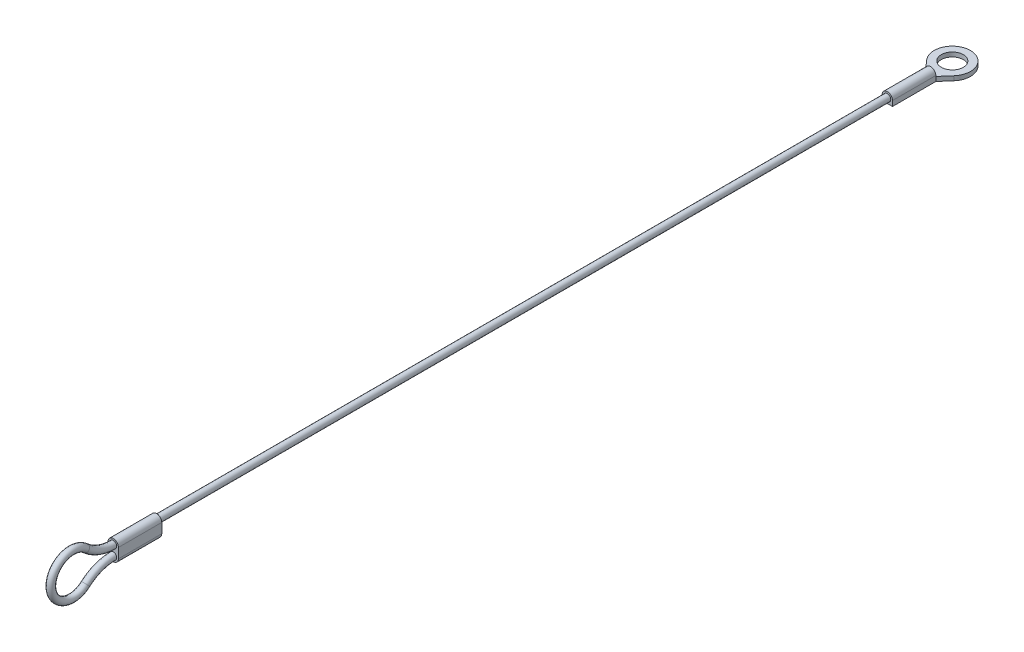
ISO-10303-21;
HEADER;
FILE_DESCRIPTION(('STEP AP214'),'2;1');
FILE_NAME('part.step','',(''),(''),'','','');
FILE_SCHEMA(('AUTOMOTIVE_DESIGN { 1 0 10303 214 1 1 1 1 }'));
ENDSEC;
DATA;
#1=APPLICATION_CONTEXT('core data for automotive mechanical design processes');
#2=APPLICATION_PROTOCOL_DEFINITION('international standard','automotive_design',2000,#1);
#3=PRODUCT_CONTEXT('',#1,'mechanical');
#4=PRODUCT('Part','Part','',(#3));
#5=PRODUCT_RELATED_PRODUCT_CATEGORY('part','',(#4));
#6=PRODUCT_DEFINITION_FORMATION('','',#4);
#7=PRODUCT_DEFINITION_CONTEXT('part definition',#1,'design');
#8=PRODUCT_DEFINITION('design','',#6,#7);
#9=PRODUCT_DEFINITION_SHAPE('','',#8);
#10=(LENGTH_UNIT() NAMED_UNIT(*) SI_UNIT(.MILLI.,.METRE.));
#11=(NAMED_UNIT(*) PLANE_ANGLE_UNIT() SI_UNIT($,.RADIAN.));
#12=(NAMED_UNIT(*) SI_UNIT($,.STERADIAN.) SOLID_ANGLE_UNIT());
#13=UNCERTAINTY_MEASURE_WITH_UNIT(LENGTH_MEASURE(1.E-05),#10,'distance_accuracy_value','');
#14=(GEOMETRIC_REPRESENTATION_CONTEXT(3) GLOBAL_UNCERTAINTY_ASSIGNED_CONTEXT((#13)) GLOBAL_UNIT_ASSIGNED_CONTEXT((#10,
#11,#12)) REPRESENTATION_CONTEXT('',''));
#15=CARTESIAN_POINT('',(0.,0.,0.));
#16=DIRECTION('',(0.,0.,1.));
#17=DIRECTION('',(1.,0.,0.));
#18=AXIS2_PLACEMENT_3D('',#15,#16,#17);
#19=CARTESIAN_POINT('',(0.,0.,-10.));
#20=DIRECTION('',(0.,0.,-1.));
#21=DIRECTION('',(-1.,0.,0.));
#22=AXIS2_PLACEMENT_3D('',#19,#20,#21);
#23=PLANE('',#22);
#24=DIRECTION('',(0.,-1.,0.));
#25=VECTOR('',#24,1.);
#26=CARTESIAN_POINT('',(1.195,0.,-10.));
#27=LINE('',#26,#25);
#28=CARTESIAN_POINT('',(1.195,0.,-10.));
#29=VERTEX_POINT('',#28);
#30=CARTESIAN_POINT('',(1.195,-0.185,-10.));
#31=VERTEX_POINT('',#30);
#32=EDGE_CURVE('E169',#29,#31,#27,.T.);
#33=ORIENTED_EDGE('',*,*,#32,.T.);
#34=DIRECTION('',(-1.,0.,0.));
#35=VECTOR('',#34,1.);
#36=CARTESIAN_POINT('',(-1.195,-0.185,-10.));
#37=LINE('',#36,#35);
#38=CARTESIAN_POINT('',(-1.195,-0.185,-10.));
#39=VERTEX_POINT('',#38);
#40=EDGE_CURVE('E138',#31,#39,#37,.T.);
#41=ORIENTED_EDGE('',*,*,#40,.T.);
#42=DIRECTION('',(0.,1.,0.));
#43=VECTOR('',#42,1.);
#44=CARTESIAN_POINT('',(-1.195,-1.195,-10.));
#45=LINE('',#44,#43);
#46=CARTESIAN_POINT('',(-1.195,0.,-10.));
#47=VERTEX_POINT('',#46);
#48=EDGE_CURVE('E173',#39,#47,#45,.T.);
#49=ORIENTED_EDGE('',*,*,#48,.T.);
#50=CARTESIAN_POINT('',(0.,0.,-10.));
#51=DIRECTION('',(0.,0.,-1.));
#52=DIRECTION('',(-1.,0.,0.));
#53=AXIS2_PLACEMENT_3D('',#50,#51,#52);
#54=CIRCLE('',#53,1.195);
#55=EDGE_CURVE('E166',#47,#29,#54,.T.);
#56=ORIENTED_EDGE('',*,*,#55,.T.);
#57=EDGE_LOOP('',(#33,#41,#49,#56));
#58=FACE_BOUND('',#57,.T.);
#59=ADVANCED_FACE('F33',(#58),#23,.T.);
#60=CARTESIAN_POINT('',(0.,0.,178.6));
#61=DIRECTION('',(0.,0.,-1.));
#62=DIRECTION('',(-1.,0.,0.));
#63=AXIS2_PLACEMENT_3D('',#60,#61,#62);
#64=CYLINDRICAL_SURFACE('',#63,0.795);
#65=CARTESIAN_POINT('',(0.,0.,168.6));
#66=DIRECTION('',(0.,0.,-1.));
#67=DIRECTION('',(0.,1.,0.));
#68=AXIS2_PLACEMENT_3D('',#65,#66,#67);
#69=CIRCLE('',#68,0.795);
#70=CARTESIAN_POINT('',(-0.795,0.,168.6));
#71=VERTEX_POINT('',#70);
#72=EDGE_CURVE('E37',#71,#71,#69,.T.);
#73=CARTESIAN_POINT('',(0.,0.,0.));
#74=DIRECTION('',(0.,0.,1.));
#75=DIRECTION('',(1.,0.,0.));
#76=AXIS2_PLACEMENT_3D('',#73,#74,#75);
#77=CIRCLE('',#76,0.795);
#78=CARTESIAN_POINT('',(-0.795,0.,0.));
#79=VERTEX_POINT('',#78);
#80=EDGE_CURVE('E195',#79,#79,#77,.T.);
#81=CARTESIAN_POINT('',(-0.795,0.,168.6));
#82=CARTESIAN_POINT('',(-0.795,0.,166.84375));
#83=CARTESIAN_POINT('',(-0.795,0.,165.0875));
#84=CARTESIAN_POINT('',(-0.795,0.,161.575));
#85=CARTESIAN_POINT('',(-0.795,0.,159.81875));
#86=CARTESIAN_POINT('',(-0.795,0.,156.30625));
#87=CARTESIAN_POINT('',(-0.795,0.,154.55));
#88=CARTESIAN_POINT('',(-0.795,0.,151.0375));
#89=CARTESIAN_POINT('',(-0.795,0.,149.28125));
#90=CARTESIAN_POINT('',(-0.795,0.,145.76875));
#91=CARTESIAN_POINT('',(-0.795,0.,144.0125));
#92=CARTESIAN_POINT('',(-0.795,0.,140.5));
#93=CARTESIAN_POINT('',(-0.795,0.,138.74375));
#94=CARTESIAN_POINT('',(-0.795,0.,135.23125));
#95=CARTESIAN_POINT('',(-0.795,0.,133.475));
#96=CARTESIAN_POINT('',(-0.795,0.,129.9625));
#97=CARTESIAN_POINT('',(-0.795,0.,128.20625));
#98=CARTESIAN_POINT('',(-0.795,0.,124.69375));
#99=CARTESIAN_POINT('',(-0.795,0.,122.9375));
#100=CARTESIAN_POINT('',(-0.795,0.,119.425));
#101=CARTESIAN_POINT('',(-0.795,0.,117.66875));
#102=CARTESIAN_POINT('',(-0.795,0.,114.15625));
#103=CARTESIAN_POINT('',(-0.795,0.,112.4));
#104=CARTESIAN_POINT('',(-0.795,0.,108.8875));
#105=CARTESIAN_POINT('',(-0.795,0.,107.13125));
#106=CARTESIAN_POINT('',(-0.795,0.,103.61875));
#107=CARTESIAN_POINT('',(-0.795,0.,101.8625));
#108=CARTESIAN_POINT('',(-0.795,0.,98.35));
#109=CARTESIAN_POINT('',(-0.795,0.,96.59375));
#110=CARTESIAN_POINT('',(-0.795,0.,93.08125));
#111=CARTESIAN_POINT('',(-0.795,0.,91.325));
#112=CARTESIAN_POINT('',(-0.795,0.,87.8125));
#113=CARTESIAN_POINT('',(-0.795,0.,86.05625));
#114=CARTESIAN_POINT('',(-0.795,0.,82.54375));
#115=CARTESIAN_POINT('',(-0.795,0.,80.7875));
#116=CARTESIAN_POINT('',(-0.795,0.,77.275));
#117=CARTESIAN_POINT('',(-0.795,0.,75.51875));
#118=CARTESIAN_POINT('',(-0.795,0.,72.00625));
#119=CARTESIAN_POINT('',(-0.795,0.,70.25));
#120=CARTESIAN_POINT('',(-0.795,0.,66.7375));
#121=CARTESIAN_POINT('',(-0.795,0.,64.98125));
#122=CARTESIAN_POINT('',(-0.795,0.,61.46875));
#123=CARTESIAN_POINT('',(-0.795,0.,59.7125));
#124=CARTESIAN_POINT('',(-0.795,0.,56.2));
#125=CARTESIAN_POINT('',(-0.795,0.,54.44375));
#126=CARTESIAN_POINT('',(-0.795,0.,50.93125));
#127=CARTESIAN_POINT('',(-0.795,0.,49.175));
#128=CARTESIAN_POINT('',(-0.795,0.,45.6625));
#129=CARTESIAN_POINT('',(-0.795,0.,43.90625));
#130=CARTESIAN_POINT('',(-0.795,0.,40.39375));
#131=CARTESIAN_POINT('',(-0.795,0.,38.6375));
#132=CARTESIAN_POINT('',(-0.795,0.,35.125));
#133=CARTESIAN_POINT('',(-0.795,0.,33.36875));
#134=CARTESIAN_POINT('',(-0.795,0.,29.85625));
#135=CARTESIAN_POINT('',(-0.795,0.,28.1));
#136=CARTESIAN_POINT('',(-0.795,0.,24.5875));
#137=CARTESIAN_POINT('',(-0.795,0.,22.83125));
#138=CARTESIAN_POINT('',(-0.795,0.,19.31875));
#139=CARTESIAN_POINT('',(-0.795,0.,17.5625));
#140=CARTESIAN_POINT('',(-0.795,0.,14.05));
#141=CARTESIAN_POINT('',(-0.795,0.,12.29375));
#142=CARTESIAN_POINT('',(-0.795,0.,8.78124999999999));
#143=CARTESIAN_POINT('',(-0.795,0.,7.02499999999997));
#144=CARTESIAN_POINT('',(-0.795,0.,3.51249999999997));
#145=CARTESIAN_POINT('',(-0.795,0.,1.75624999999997));
#146=CARTESIAN_POINT('',(-0.795,0.,0.));
#147=B_SPLINE_CURVE_WITH_KNOTS('',3,(#81,#82,#83,#84,#85,#86,#87,#88,#89,#90,#91,#92,#93,#94,
#95,#96,#97,#98,#99,#100,#101,#102,#103,#104,#105,#106,#107,#108,#109,#110,#111,#112,#113,#114,
#115,#116,#117,#118,#119,#120,#121,#122,#123,#124,#125,#126,#127,#128,#129,#130,#131,#132,#133,
#134,#135,#136,#137,#138,#139,#140,#141,#142,#143,#144,#145,#146),.UNSPECIFIED.,.F.,.F.,(4,2,2,
2,2,2,2,2,2,2,2,2,2,2,2,2,2,2,2,2,2,2,2,2,2,2,2,2,2,2,2,2,4),(0.,5.26875000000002,10.5375,
15.80625,21.075,26.34375,31.6125,36.88125,42.15,47.41875,52.6875,57.95625,63.225,68.49375,
73.7625,79.03125,84.3,89.5687500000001,94.8375,100.10625,105.375,110.64375,115.9125,121.18125,
126.45,131.71875,136.9875,142.25625,147.525,152.79375,158.0625,163.33125,168.6),.UNSPECIFIED.);
#148=EDGE_CURVE('BSEAM35',#71,#79,#147,.T.);
#149=ORIENTED_EDGE('',*,*,#72,.T.);
#150=ORIENTED_EDGE('',*,*,#80,.T.);
#151=ORIENTED_EDGE('',*,*,#148,.T.);
#152=ORIENTED_EDGE('',*,*,#148,.F.);
#153=EDGE_LOOP('',(#149,#151,#150,#152));
#154=FACE_BOUND('',#153,.T.);
#155=ADVANCED_FACE('F35',(#154),#64,.T.);
#156=CARTESIAN_POINT('',(0.,2.43728648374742E-13,168.6));
#157=DIRECTION('',(0.,0.,1.));
#158=DIRECTION('',(0.,-1.,0.));
#159=AXIS2_PLACEMENT_3D('',#156,#157,#158);
#160=CYLINDRICAL_SURFACE('',#159,1.195);
#161=CARTESIAN_POINT('',(0.,2.58184677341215E-13,178.6));
#162=DIRECTION('',(0.,0.,-1.));
#163=DIRECTION('',(0.,1.,0.));
#164=AXIS2_PLACEMENT_3D('',#161,#162,#163);
#165=CIRCLE('',#164,1.195);
#166=CARTESIAN_POINT('',(-1.195,2.58331022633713E-13,178.6));
#167=VERTEX_POINT('',#166);
#168=CARTESIAN_POINT('',(1.195,2.58038332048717E-13,178.6));
#169=VERTEX_POINT('',#168);
#170=EDGE_CURVE('E203',#167,#169,#165,.T.);
#171=ORIENTED_EDGE('',*,*,#170,.T.);
#172=DIRECTION('',(0.,0.,1.));
#173=VECTOR('',#172,1.);
#174=CARTESIAN_POINT('',(1.195,2.43582303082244E-13,168.6));
#175=LINE('',#174,#173);
#176=CARTESIAN_POINT('',(1.195,2.43582303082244E-13,168.6));
#177=VERTEX_POINT('',#176);
#178=EDGE_CURVE('E217',#177,#169,#175,.T.);
#179=ORIENTED_EDGE('',*,*,#178,.F.);
#180=CARTESIAN_POINT('',(0.,2.43728648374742E-13,168.6));
#181=DIRECTION('',(0.,0.,-1.));
#182=DIRECTION('',(0.,1.,0.));
#183=AXIS2_PLACEMENT_3D('',#180,#181,#182);
#184=CIRCLE('',#183,1.195);
#185=CARTESIAN_POINT('',(-1.195,2.4387499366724E-13,168.6));
#186=VERTEX_POINT('',#185);
#187=EDGE_CURVE('E196',#186,#177,#184,.T.);
#188=ORIENTED_EDGE('',*,*,#187,.F.);
#189=DIRECTION('',(0.,0.,1.));
#190=VECTOR('',#189,1.);
#191=CARTESIAN_POINT('',(-1.195,2.4387499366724E-13,168.6));
#192=LINE('',#191,#190);
#193=EDGE_CURVE('E202',#186,#167,#192,.T.);
#194=ORIENTED_EDGE('',*,*,#193,.T.);
#195=EDGE_LOOP('',(#171,#179,#188,#194));
#196=FACE_BOUND('',#195,.T.);
#197=ADVANCED_FACE('F258',(#196),#160,.T.);
#198=CARTESIAN_POINT('',(1.195,2.43582303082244E-13,168.6));
#199=DIRECTION('',(-1.,0.,0.));
#200=DIRECTION('',(0.,-1.,0.));
#201=AXIS2_PLACEMENT_3D('',#198,#199,#200);
#202=PLANE('',#201);
#203=DIRECTION('',(0.,-1.,0.));
#204=VECTOR('',#203,1.);
#205=CARTESIAN_POINT('',(1.195,2.58038332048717E-13,178.6));
#206=LINE('',#205,#204);
#207=CARTESIAN_POINT('',(1.195,-2.26625258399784,178.6));
#208=VERTEX_POINT('',#207);
#209=EDGE_CURVE('E206',#169,#208,#206,.T.);
#210=ORIENTED_EDGE('',*,*,#209,.T.);
#211=DIRECTION('',(0.,0.,1.));
#212=VECTOR('',#211,1.);
#213=CARTESIAN_POINT('',(1.195,-2.26625258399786,168.6));
#214=LINE('',#213,#212);
#215=CARTESIAN_POINT('',(1.195,-2.26625258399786,168.6));
#216=VERTEX_POINT('',#215);
#217=EDGE_CURVE('E214',#216,#208,#214,.T.);
#218=ORIENTED_EDGE('',*,*,#217,.F.);
#219=DIRECTION('',(0.,-1.,0.));
#220=VECTOR('',#219,1.);
#221=CARTESIAN_POINT('',(1.195,2.43582303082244E-13,168.6));
#222=LINE('',#221,#220);
#223=EDGE_CURVE('E88',#177,#216,#222,.T.);
#224=ORIENTED_EDGE('',*,*,#223,.F.);
#225=ORIENTED_EDGE('',*,*,#178,.T.);
#226=EDGE_LOOP('',(#210,#218,#224,#225));
#227=FACE_BOUND('',#226,.T.);
#228=ADVANCED_FACE('F287',(#227),#202,.F.);
#229=CARTESIAN_POINT('',(0.,-2.26625258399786,168.6));
#230=DIRECTION('',(0.,0.,1.));
#231=DIRECTION('',(0.,-1.,0.));
#232=AXIS2_PLACEMENT_3D('',#229,#230,#231);
#233=CYLINDRICAL_SURFACE('',#232,1.195);
#234=CARTESIAN_POINT('',(0.,-2.26625258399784,178.6));
#235=DIRECTION('',(0.,0.,-1.));
#236=DIRECTION('',(0.,1.,0.));
#237=AXIS2_PLACEMENT_3D('',#234,#235,#236);
#238=CIRCLE('',#237,1.195);
#239=CARTESIAN_POINT('',(-1.195,-2.26625258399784,178.6));
#240=VERTEX_POINT('',#239);
#241=EDGE_CURVE('E208',#208,#240,#238,.T.);
#242=ORIENTED_EDGE('',*,*,#241,.T.);
#243=DIRECTION('',(0.,0.,1.));
#244=VECTOR('',#243,1.);
#245=CARTESIAN_POINT('',(-1.195,-2.26625258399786,168.6));
#246=LINE('',#245,#244);
#247=CARTESIAN_POINT('',(-1.195,-2.26625258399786,168.6));
#248=VERTEX_POINT('',#247);
#249=EDGE_CURVE('E212',#248,#240,#246,.T.);
#250=ORIENTED_EDGE('',*,*,#249,.F.);
#251=CARTESIAN_POINT('',(0.,-2.26625258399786,168.6));
#252=DIRECTION('',(0.,0.,-1.));
#253=DIRECTION('',(0.,1.,0.));
#254=AXIS2_PLACEMENT_3D('',#251,#252,#253);
#255=CIRCLE('',#254,1.195);
#256=EDGE_CURVE('E199',#216,#248,#255,.T.);
#257=ORIENTED_EDGE('',*,*,#256,.F.);
#258=ORIENTED_EDGE('',*,*,#217,.T.);
#259=EDGE_LOOP('',(#242,#250,#257,#258));
#260=FACE_BOUND('',#259,.T.);
#261=ADVANCED_FACE('F284',(#260),#233,.T.);
#262=CARTESIAN_POINT('',(-1.195,2.4387499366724E-13,168.6));
#263=DIRECTION('',(1.,0.,0.));
#264=DIRECTION('',(0.,0.,-1.));
#265=AXIS2_PLACEMENT_3D('',#262,#263,#264);
#266=PLANE('',#265);
#267=DIRECTION('',(0.,1.,0.));
#268=VECTOR('',#267,1.);
#269=CARTESIAN_POINT('',(-1.195,2.58331022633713E-13,178.6));
#270=LINE('',#269,#268);
#271=EDGE_CURVE('E80',#240,#167,#270,.T.);
#272=ORIENTED_EDGE('',*,*,#271,.T.);
#273=ORIENTED_EDGE('',*,*,#193,.F.);
#274=DIRECTION('',(0.,1.,0.));
#275=VECTOR('',#274,1.);
#276=CARTESIAN_POINT('',(-1.195,2.4387499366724E-13,168.6));
#277=LINE('',#276,#275);
#278=EDGE_CURVE('E59',#248,#186,#277,.T.);
#279=ORIENTED_EDGE('',*,*,#278,.F.);
#280=ORIENTED_EDGE('',*,*,#249,.T.);
#281=EDGE_LOOP('',(#272,#273,#279,#280));
#282=FACE_BOUND('',#281,.T.);
#283=ADVANCED_FACE('F276',(#282),#266,.F.);
#284=CARTESIAN_POINT('',(0.,2.43728648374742E-13,168.6));
#285=DIRECTION('',(0.,0.,-1.));
#286=DIRECTION('',(0.,1.,0.));
#287=AXIS2_PLACEMENT_3D('',#284,#285,#286);
#288=PLANE('',#287);
#289=ORIENTED_EDGE('',*,*,#72,.F.);
#290=EDGE_LOOP('',(#289));
#291=FACE_BOUND('',#290,.T.);
#292=ORIENTED_EDGE('',*,*,#187,.T.);
#293=ORIENTED_EDGE('',*,*,#223,.T.);
#294=ORIENTED_EDGE('',*,*,#256,.T.);
#295=ORIENTED_EDGE('',*,*,#278,.T.);
#296=EDGE_LOOP('',(#292,#293,#294,#295));
#297=FACE_BOUND('',#296,.T.);
#298=ADVANCED_FACE('F272',(#291,#297),#288,.T.);
#299=CARTESIAN_POINT('',(0.,2.58184677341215E-13,178.6));
#300=DIRECTION('',(0.,0.,-1.));
#301=DIRECTION('',(0.,1.,0.));
#302=AXIS2_PLACEMENT_3D('',#299,#300,#301);
#303=PLANE('',#302);
#304=CARTESIAN_POINT('',(0.,-2.26625258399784,178.6));
#305=DIRECTION('',(0.,0.,-1.));
#306=DIRECTION('',(1.,0.,0.));
#307=AXIS2_PLACEMENT_3D('',#304,#305,#306);
#308=CIRCLE('',#307,0.795);
#309=CARTESIAN_POINT('',(0.,-1.47125258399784,178.6));
#310=VERTEX_POINT('',#309);
#311=EDGE_CURVE('E222',#310,#310,#308,.T.);
#312=ORIENTED_EDGE('',*,*,#311,.T.);
#313=EDGE_LOOP('',(#312));
#314=FACE_BOUND('',#313,.T.);
#315=CARTESIAN_POINT('',(0.,0.,178.6));
#316=DIRECTION('',(0.,0.,-1.));
#317=DIRECTION('',(0.,1.,0.));
#318=AXIS2_PLACEMENT_3D('',#315,#316,#317);
#319=CIRCLE('',#318,0.795);
#320=CARTESIAN_POINT('',(0.,-0.795000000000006,178.6));
#321=VERTEX_POINT('',#320);
#322=EDGE_CURVE('E219',#321,#321,#319,.T.);
#323=ORIENTED_EDGE('',*,*,#322,.T.);
#324=EDGE_LOOP('',(#323));
#325=FACE_BOUND('',#324,.T.);
#326=ORIENTED_EDGE('',*,*,#170,.F.);
#327=ORIENTED_EDGE('',*,*,#271,.F.);
#328=ORIENTED_EDGE('',*,*,#241,.F.);
#329=ORIENTED_EDGE('',*,*,#209,.F.);
#330=EDGE_LOOP('',(#326,#327,#328,#329));
#331=FACE_BOUND('',#330,.T.);
#332=ADVANCED_FACE('F275',(#314,#325,#331),#303,.F.);
#333=CARTESIAN_POINT('',(0.,-11.8662525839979,178.6));
#334=DIRECTION('',(1.,0.,0.));
#335=DIRECTION('',(0.,0.,-1.));
#336=AXIS2_PLACEMENT_3D('',#333,#334,#335);
#337=TOROIDAL_SURFACE('',#336,9.60000000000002,0.795);
#338=CARTESIAN_POINT('',(0.,-4.71083505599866,185.));
#339=DIRECTION('',(0.,0.666666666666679,-0.745355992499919));
#340=DIRECTION('',(1.,0.,0.));
#341=AXIS2_PLACEMENT_3D('',#338,#339,#340);
#342=CIRCLE('',#341,0.795);
#343=CARTESIAN_POINT('',(0.,-4.11827704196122,185.53));
#344=VERTEX_POINT('',#343);
#345=EDGE_CURVE('E42',#344,#344,#342,.T.);
#346=CARTESIAN_POINT('',(0.,-11.8662525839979,178.6));
#347=DIRECTION('',(1.,0.,0.));
#348=DIRECTION('',(0.,0.,-1.));
#349=AXIS2_PLACEMENT_3D('',#346,#347,#348);
#350=CIRCLE('',#349,10.395);
#351=EDGE_CURVE('',#310,#344,#350,.T.);
#352=ORIENTED_EDGE('',*,*,#311,.F.);
#353=ORIENTED_EDGE('',*,*,#345,.T.);
#354=ORIENTED_EDGE('',*,*,#351,.T.);
#355=ORIENTED_EDGE('',*,*,#351,.F.);
#356=EDGE_LOOP('',(#352,#354,#353,#355));
#357=FACE_BOUND('',#356,.T.);
#358=ADVANCED_FACE('F280',(#357),#337,.T.);
#359=CARTESIAN_POINT('',(0.,-1.13312629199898,188.2));
#360=DIRECTION('',(-1.,0.,0.));
#361=DIRECTION('',(0.,0.,1.));
#362=AXIS2_PLACEMENT_3D('',#359,#360,#361);
#363=TOROIDAL_SURFACE('',#362,4.80000000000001,0.795);
#364=CARTESIAN_POINT('',(0.,2.44458247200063,185.));
#365=DIRECTION('',(0.,0.666666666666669,0.745355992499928));
#366=DIRECTION('',(1.,0.,0.));
#367=AXIS2_PLACEMENT_3D('',#364,#365,#366);
#368=CIRCLE('',#367,0.795);
#369=CARTESIAN_POINT('',(0.,1.85202445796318,185.53));
#370=VERTEX_POINT('',#369);
#371=EDGE_CURVE('E11',#370,#370,#368,.T.);
#372=ORIENTED_EDGE('',*,*,#371,.T.);
#373=EDGE_LOOP('',(#372));
#374=FACE_BOUND('',#373,.T.);
#375=ORIENTED_EDGE('',*,*,#345,.F.);
#376=EDGE_LOOP('',(#375));
#377=FACE_BOUND('',#376,.T.);
#378=ADVANCED_FACE('F296',(#374,#377),#363,.T.);
#379=CARTESIAN_POINT('',(0.,9.6,178.6));
#380=DIRECTION('',(1.,0.,0.));
#381=DIRECTION('',(0.,0.,-1.));
#382=AXIS2_PLACEMENT_3D('',#379,#380,#381);
#383=TOROIDAL_SURFACE('',#382,9.6,0.795);
#384=CARTESIAN_POINT('',(0.,9.6,178.6));
#385=DIRECTION('',(1.,0.,0.));
#386=DIRECTION('',(0.,0.,-1.));
#387=AXIS2_PLACEMENT_3D('',#384,#385,#386);
#388=CIRCLE('',#387,10.395);
#389=EDGE_CURVE('',#370,#321,#388,.T.);
#390=ORIENTED_EDGE('',*,*,#371,.F.);
#391=ORIENTED_EDGE('',*,*,#322,.F.);
#392=ORIENTED_EDGE('',*,*,#389,.T.);
#393=ORIENTED_EDGE('',*,*,#389,.F.);
#394=EDGE_LOOP('',(#390,#392,#391,#393));
#395=FACE_BOUND('',#394,.T.);
#396=ADVANCED_FACE('F271',(#395),#383,.T.);
#397=CARTESIAN_POINT('',(0.,0.,-10.));
#398=DIRECTION('',(0.,0.,1.));
#399=DIRECTION('',(1.,0.,0.));
#400=AXIS2_PLACEMENT_3D('',#397,#398,#399);
#401=CYLINDRICAL_SURFACE('',#400,1.195);
#402=CARTESIAN_POINT('',(0.,0.,0.));
#403=DIRECTION('',(0.,0.,-1.));
#404=DIRECTION('',(-1.,0.,0.));
#405=AXIS2_PLACEMENT_3D('',#402,#403,#404);
#406=CIRCLE('',#405,1.195);
#407=CARTESIAN_POINT('',(-1.195,0.,0.));
#408=VERTEX_POINT('',#407);
#409=CARTESIAN_POINT('',(1.195,0.,0.));
#410=VERTEX_POINT('',#409);
#411=EDGE_CURVE('E164',#408,#410,#406,.T.);
#412=ORIENTED_EDGE('',*,*,#411,.T.);
#413=DIRECTION('',(0.,0.,1.));
#414=VECTOR('',#413,1.);
#415=CARTESIAN_POINT('',(1.195,0.,-10.));
#416=LINE('',#415,#414);
#417=EDGE_CURVE('E192',#29,#410,#416,.T.);
#418=ORIENTED_EDGE('',*,*,#417,.F.);
#419=ORIENTED_EDGE('',*,*,#55,.F.);
#420=DIRECTION('',(0.,0.,1.));
#421=VECTOR('',#420,1.);
#422=CARTESIAN_POINT('',(-1.195,0.,-10.));
#423=LINE('',#422,#421);
#424=EDGE_CURVE('E175',#47,#408,#423,.T.);
#425=ORIENTED_EDGE('',*,*,#424,.T.);
#426=EDGE_LOOP('',(#412,#418,#419,#425));
#427=FACE_BOUND('',#426,.T.);
#428=ADVANCED_FACE('F239',(#427),#401,.T.);
#429=CARTESIAN_POINT('',(1.195,0.,-10.));
#430=DIRECTION('',(-1.,0.,0.));
#431=DIRECTION('',(0.,-1.,0.));
#432=AXIS2_PLACEMENT_3D('',#429,#430,#431);
#433=PLANE('',#432);
#434=DIRECTION('',(0.,-1.,0.));
#435=VECTOR('',#434,1.);
#436=CARTESIAN_POINT('',(1.195,0.,0.));
#437=LINE('',#436,#435);
#438=CARTESIAN_POINT('',(1.195,-1.195,0.));
#439=VERTEX_POINT('',#438);
#440=EDGE_CURVE('E178',#410,#439,#437,.T.);
#441=ORIENTED_EDGE('',*,*,#440,.T.);
#442=DIRECTION('',(0.,0.,1.));
#443=VECTOR('',#442,1.);
#444=CARTESIAN_POINT('',(1.195,-1.195,-10.));
#445=LINE('',#444,#443);
#446=CARTESIAN_POINT('',(1.195,-1.195,-10.));
#447=VERTEX_POINT('',#446);
#448=EDGE_CURVE('E189',#447,#439,#445,.T.);
#449=ORIENTED_EDGE('',*,*,#448,.F.);
#450=DIRECTION('',(0.,-1.,0.));
#451=VECTOR('',#450,1.);
#452=CARTESIAN_POINT('',(1.195,-0.185,-10.));
#453=LINE('',#452,#451);
#454=EDGE_CURVE('E162',#31,#447,#453,.T.);
#455=ORIENTED_EDGE('',*,*,#454,.F.);
#456=ORIENTED_EDGE('',*,*,#32,.F.);
#457=ORIENTED_EDGE('',*,*,#417,.T.);
#458=EDGE_LOOP('',(#441,#449,#455,#456,#457));
#459=FACE_BOUND('',#458,.T.);
#460=ADVANCED_FACE('F250',(#459),#433,.F.);
#461=CARTESIAN_POINT('',(0.,-1.195,-10.));
#462=DIRECTION('',(0.,1.,0.));
#463=DIRECTION('',(0.,0.,1.));
#464=AXIS2_PLACEMENT_3D('',#461,#462,#463);
#465=PLANE('',#464);
#466=DIRECTION('',(-1.,0.,0.));
#467=VECTOR('',#466,1.);
#468=CARTESIAN_POINT('',(0.,-1.195,0.));
#469=LINE('',#468,#467);
#470=CARTESIAN_POINT('',(-1.195,-1.195,0.));
#471=VERTEX_POINT('',#470);
#472=EDGE_CURVE('E181',#439,#471,#469,.T.);
#473=ORIENTED_EDGE('',*,*,#472,.T.);
#474=DIRECTION('',(0.,0.,1.));
#475=VECTOR('',#474,1.);
#476=CARTESIAN_POINT('',(-1.195,-1.195,-10.));
#477=LINE('',#476,#475);
#478=CARTESIAN_POINT('',(-1.195,-1.195,-10.));
#479=VERTEX_POINT('',#478);
#480=EDGE_CURVE('E186',#479,#471,#477,.T.);
#481=ORIENTED_EDGE('',*,*,#480,.F.);
#482=DIRECTION('',(-0.658036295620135,0.,-0.752986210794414));
#483=VECTOR('',#482,1.);
#484=CARTESIAN_POINT('',(-3.15501222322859,-1.195,-12.2428279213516));
#485=LINE('',#484,#483);
#486=CARTESIAN_POINT('',(-3.1550122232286,-1.195,-12.2428279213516));
#487=VERTEX_POINT('',#486);
#488=EDGE_CURVE('E158',#479,#487,#485,.T.);
#489=ORIENTED_EDGE('',*,*,#488,.T.);
#490=CARTESIAN_POINT('',(0.,-1.195,-15.));
#491=DIRECTION('',(0.,-1.,0.));
#492=DIRECTION('',(0.,0.,1.));
#493=AXIS2_PLACEMENT_3D('',#490,#491,#492);
#494=CIRCLE('',#493,4.19);
#495=CARTESIAN_POINT('',(3.15501222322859,-1.195,-12.2428279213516));
#496=VERTEX_POINT('',#495);
#497=EDGE_CURVE('E134',#487,#496,#494,.T.);
#498=ORIENTED_EDGE('',*,*,#497,.T.);
#499=DIRECTION('',(-0.658036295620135,0.,0.752986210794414));
#500=VECTOR('',#499,1.);
#501=CARTESIAN_POINT('',(1.195,-1.195,-10.));
#502=LINE('',#501,#500);
#503=EDGE_CURVE('E148',#496,#447,#502,.T.);
#504=ORIENTED_EDGE('',*,*,#503,.T.);
#505=ORIENTED_EDGE('',*,*,#448,.T.);
#506=EDGE_LOOP('',(#473,#481,#489,#498,#504,#505));
#507=FACE_BOUND('',#506,.T.);
#508=CARTESIAN_POINT('',(0.,-1.195,-15.));
#509=DIRECTION('',(0.,-1.,0.));
#510=DIRECTION('',(0.,0.,-1.));
#511=AXIS2_PLACEMENT_3D('',#508,#509,#510);
#512=CIRCLE('',#511,2.54);
#513=CARTESIAN_POINT('',(0.,-1.195,-17.54));
#514=VERTEX_POINT('',#513);
#515=EDGE_CURVE('E153',#514,#514,#512,.T.);
#516=ORIENTED_EDGE('',*,*,#515,.F.);
#517=EDGE_LOOP('',(#516));
#518=FACE_BOUND('',#517,.T.);
#519=ADVANCED_FACE('F246',(#507,#518),#465,.F.);
#520=CARTESIAN_POINT('',(-1.195,-1.195,-10.));
#521=DIRECTION('',(1.,0.,0.));
#522=DIRECTION('',(0.,1.,0.));
#523=AXIS2_PLACEMENT_3D('',#520,#521,#522);
#524=PLANE('',#523);
#525=DIRECTION('',(0.,1.,0.));
#526=VECTOR('',#525,1.);
#527=CARTESIAN_POINT('',(-1.195,-1.195,0.));
#528=LINE('',#527,#526);
#529=EDGE_CURVE('E170',#471,#408,#528,.T.);
#530=ORIENTED_EDGE('',*,*,#529,.T.);
#531=ORIENTED_EDGE('',*,*,#424,.F.);
#532=ORIENTED_EDGE('',*,*,#48,.F.);
#533=EDGE_CURVE('E146',#479,#39,#45,.T.);
#534=ORIENTED_EDGE('',*,*,#533,.F.);
#535=ORIENTED_EDGE('',*,*,#480,.T.);
#536=EDGE_LOOP('',(#530,#531,#532,#534,#535));
#537=FACE_BOUND('',#536,.T.);
#538=ADVANCED_FACE('F233',(#537),#524,.F.);
#539=CARTESIAN_POINT('',(0.,0.,0.));
#540=DIRECTION('',(0.,0.,-1.));
#541=DIRECTION('',(-1.,0.,0.));
#542=AXIS2_PLACEMENT_3D('',#539,#540,#541);
#543=PLANE('',#542);
#544=ORIENTED_EDGE('',*,*,#80,.F.);
#545=EDGE_LOOP('',(#544));
#546=FACE_BOUND('',#545,.T.);
#547=ORIENTED_EDGE('',*,*,#411,.F.);
#548=ORIENTED_EDGE('',*,*,#529,.F.);
#549=ORIENTED_EDGE('',*,*,#472,.F.);
#550=ORIENTED_EDGE('',*,*,#440,.F.);
#551=EDGE_LOOP('',(#547,#548,#549,#550));
#552=FACE_BOUND('',#551,.T.);
#553=ADVANCED_FACE('F230',(#546,#552),#543,.F.);
#554=CARTESIAN_POINT('',(-3.15501222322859,-0.185,-12.2428279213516));
#555=DIRECTION('',(-0.752986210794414,0.,0.658036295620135));
#556=DIRECTION('',(0.658036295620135,0.,0.752986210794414));
#557=AXIS2_PLACEMENT_3D('',#554,#555,#556);
#558=PLANE('',#557);
#559=ORIENTED_EDGE('',*,*,#488,.F.);
#560=ORIENTED_EDGE('',*,*,#533,.T.);
#561=DIRECTION('',(-0.658036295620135,0.,-0.752986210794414));
#562=VECTOR('',#561,1.);
#563=CARTESIAN_POINT('',(-3.15501222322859,-0.185,-12.2428279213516));
#564=LINE('',#563,#562);
#565=CARTESIAN_POINT('',(-3.1550122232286,-0.185,-12.2428279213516));
#566=VERTEX_POINT('',#565);
#567=EDGE_CURVE('E50',#39,#566,#564,.T.);
#568=ORIENTED_EDGE('',*,*,#567,.T.);
#569=DIRECTION('',(0.,-1.,0.));
#570=VECTOR('',#569,1.);
#571=CARTESIAN_POINT('',(-3.1550122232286,-0.185,-12.2428279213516));
#572=LINE('',#571,#570);
#573=EDGE_CURVE('E130',#566,#487,#572,.T.);
#574=ORIENTED_EDGE('',*,*,#573,.T.);
#575=EDGE_LOOP('',(#559,#560,#568,#574));
#576=FACE_BOUND('',#575,.T.);
#577=ADVANCED_FACE('F144',(#576),#558,.T.);
#578=CARTESIAN_POINT('',(1.195,-0.185,-10.));
#579=DIRECTION('',(0.752986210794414,0.,0.658036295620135));
#580=DIRECTION('',(0.658036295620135,0.,-0.752986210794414));
#581=AXIS2_PLACEMENT_3D('',#578,#579,#580);
#582=PLANE('',#581);
#583=ORIENTED_EDGE('',*,*,#503,.F.);
#584=DIRECTION('',(0.,-1.,0.));
#585=VECTOR('',#584,1.);
#586=CARTESIAN_POINT('',(3.15501222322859,-0.185,-12.2428279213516));
#587=LINE('',#586,#585);
#588=CARTESIAN_POINT('',(3.15501222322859,-0.185,-12.2428279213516));
#589=VERTEX_POINT('',#588);
#590=EDGE_CURVE('E137',#589,#496,#587,.T.);
#591=ORIENTED_EDGE('',*,*,#590,.F.);
#592=DIRECTION('',(-0.658036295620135,0.,0.752986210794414));
#593=VECTOR('',#592,1.);
#594=CARTESIAN_POINT('',(1.195,-0.185,-10.));
#595=LINE('',#594,#593);
#596=EDGE_CURVE('E142',#589,#31,#595,.T.);
#597=ORIENTED_EDGE('',*,*,#596,.T.);
#598=ORIENTED_EDGE('',*,*,#454,.T.);
#599=EDGE_LOOP('',(#583,#591,#597,#598));
#600=FACE_BOUND('',#599,.T.);
#601=ADVANCED_FACE('F349',(#600),#582,.T.);
#602=CARTESIAN_POINT('',(0.,-0.185,-15.));
#603=DIRECTION('',(0.,-1.,0.));
#604=DIRECTION('',(0.,0.,-1.));
#605=AXIS2_PLACEMENT_3D('',#602,#603,#604);
#606=CYLINDRICAL_SURFACE('',#605,4.19);
#607=ORIENTED_EDGE('',*,*,#497,.F.);
#608=ORIENTED_EDGE('',*,*,#573,.F.);
#609=CARTESIAN_POINT('',(0.,-0.185,-15.));
#610=DIRECTION('',(0.,-1.,0.));
#611=DIRECTION('',(0.,0.,1.));
#612=AXIS2_PLACEMENT_3D('',#609,#610,#611);
#613=CIRCLE('',#612,4.19);
#614=EDGE_CURVE('E132',#566,#589,#613,.T.);
#615=ORIENTED_EDGE('',*,*,#614,.T.);
#616=ORIENTED_EDGE('',*,*,#590,.T.);
#617=EDGE_LOOP('',(#607,#608,#615,#616));
#618=FACE_BOUND('',#617,.T.);
#619=ADVANCED_FACE('F131',(#618),#606,.T.);
#620=CARTESIAN_POINT('',(0.,-0.185,-15.));
#621=DIRECTION('',(0.,1.,0.));
#622=DIRECTION('',(0.,0.,1.));
#623=AXIS2_PLACEMENT_3D('',#620,#621,#622);
#624=PLANE('',#623);
#625=CARTESIAN_POINT('',(0.,-0.185,-15.));
#626=DIRECTION('',(0.,-1.,0.));
#627=DIRECTION('',(0.,0.,-1.));
#628=AXIS2_PLACEMENT_3D('',#625,#626,#627);
#629=CIRCLE('',#628,2.54);
#630=CARTESIAN_POINT('',(0.,-0.185,-17.54));
#631=VERTEX_POINT('',#630);
#632=EDGE_CURVE('E160',#631,#631,#629,.T.);
#633=ORIENTED_EDGE('',*,*,#632,.T.);
#634=EDGE_LOOP('',(#633));
#635=FACE_BOUND('',#634,.T.);
#636=ORIENTED_EDGE('',*,*,#567,.F.);
#637=ORIENTED_EDGE('',*,*,#40,.F.);
#638=ORIENTED_EDGE('',*,*,#596,.F.);
#639=ORIENTED_EDGE('',*,*,#614,.F.);
#640=EDGE_LOOP('',(#636,#637,#638,#639));
#641=FACE_BOUND('',#640,.T.);
#642=ADVANCED_FACE('F141',(#635,#641),#624,.T.);
#643=CARTESIAN_POINT('',(0.,-0.185,-15.));
#644=DIRECTION('',(0.,-1.,0.));
#645=DIRECTION('',(0.,0.,-1.));
#646=AXIS2_PLACEMENT_3D('',#643,#644,#645);
#647=CYLINDRICAL_SURFACE('',#646,2.54);
#648=ORIENTED_EDGE('',*,*,#632,.F.);
#649=EDGE_LOOP('',(#648));
#650=FACE_BOUND('',#649,.T.);
#651=ORIENTED_EDGE('',*,*,#515,.T.);
#652=EDGE_LOOP('',(#651));
#653=FACE_BOUND('',#652,.T.);
#654=ADVANCED_FACE('F367',(#650,#653),#647,.F.);
#655=CLOSED_SHELL('',(#59,#155,#197,#228,#261,#283,#298,#332,#358,#378,#396,#428,#460,#519,#538,
#553,#577,#601,#619,#642,#654));
#656=MANIFOLD_SOLID_BREP('B2',#655);
#657=ADVANCED_BREP_SHAPE_REPRESENTATION('',(#18,#656),#14);
#658=SHAPE_DEFINITION_REPRESENTATION(#9,#657);
ENDSEC;
END-ISO-10303-21;
